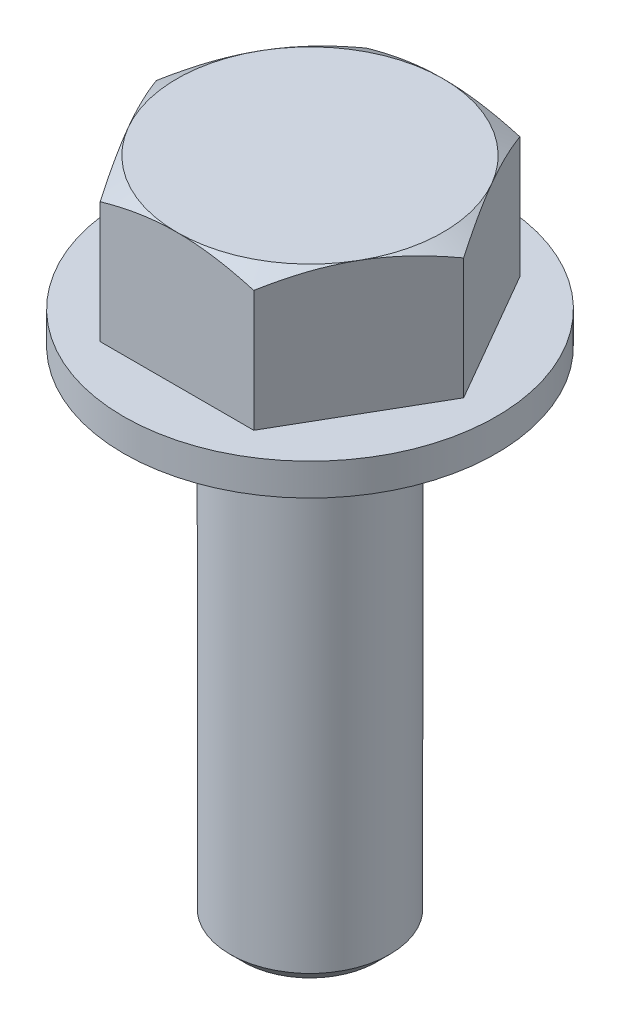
ISO-10303-21;
HEADER;
FILE_DESCRIPTION(('STEP AP214'),'2;1');
FILE_NAME('part.step','',(''),(''),'','','');
FILE_SCHEMA(('AUTOMOTIVE_DESIGN { 1 0 10303 214 1 1 1 1 }'));
ENDSEC;
DATA;
#1=APPLICATION_CONTEXT('core data for automotive mechanical design processes');
#2=APPLICATION_PROTOCOL_DEFINITION('international standard','automotive_design',2000,#1);
#3=PRODUCT_CONTEXT('',#1,'mechanical');
#4=PRODUCT('Part','Part','',(#3));
#5=PRODUCT_RELATED_PRODUCT_CATEGORY('part','',(#4));
#6=PRODUCT_DEFINITION_FORMATION('','',#4);
#7=PRODUCT_DEFINITION_CONTEXT('part definition',#1,'design');
#8=PRODUCT_DEFINITION('design','',#6,#7);
#9=PRODUCT_DEFINITION_SHAPE('','',#8);
#10=(LENGTH_UNIT() NAMED_UNIT(*) SI_UNIT(.MILLI.,.METRE.));
#11=(NAMED_UNIT(*) PLANE_ANGLE_UNIT() SI_UNIT($,.RADIAN.));
#12=(NAMED_UNIT(*) SI_UNIT($,.STERADIAN.) SOLID_ANGLE_UNIT());
#13=UNCERTAINTY_MEASURE_WITH_UNIT(LENGTH_MEASURE(1.E-05),#10,'distance_accuracy_value','');
#14=(GEOMETRIC_REPRESENTATION_CONTEXT(3) GLOBAL_UNCERTAINTY_ASSIGNED_CONTEXT((#13)) GLOBAL_UNIT_ASSIGNED_CONTEXT((#10,
#11,#12)) REPRESENTATION_CONTEXT('',''));
#15=CARTESIAN_POINT('',(0.,0.,0.));
#16=DIRECTION('',(0.,0.,1.));
#17=DIRECTION('',(1.,0.,0.));
#18=AXIS2_PLACEMENT_3D('',#15,#16,#17);
#19=CARTESIAN_POINT('',(8.66025403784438,-2.5,-5.00000000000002));
#20=DIRECTION('',(0.,1.,0.));
#21=DIRECTION('',(0.,0.,1.));
#22=AXIS2_PLACEMENT_3D('',#19,#20,#21);
#23=PLANE('',#22);
#24=CARTESIAN_POINT('',(0.,-2.5,0.));
#25=DIRECTION('',(0.,1.,0.));
#26=DIRECTION('',(0.,0.,1.));
#27=AXIS2_PLACEMENT_3D('',#24,#25,#26);
#28=CIRCLE('',#27,3.);
#29=CARTESIAN_POINT('',(0.,-2.5,3.));
#30=VERTEX_POINT('',#29);
#31=EDGE_CURVE('E147',#30,#30,#28,.F.);
#32=ORIENTED_EDGE('',*,*,#31,.F.);
#33=EDGE_LOOP('',(#32));
#34=FACE_BOUND('',#33,.T.);
#35=CARTESIAN_POINT('',(0.,-2.5,0.));
#36=DIRECTION('',(0.,1.,0.));
#37=DIRECTION('',(0.,0.,1.));
#38=AXIS2_PLACEMENT_3D('',#35,#36,#37);
#39=CIRCLE('',#38,3.5);
#40=CARTESIAN_POINT('',(0.,-2.5,3.5));
#41=VERTEX_POINT('',#40);
#42=EDGE_CURVE('E11',#41,#41,#39,.T.);
#43=ORIENTED_EDGE('',*,*,#42,.F.);
#44=EDGE_LOOP('',(#43));
#45=FACE_BOUND('',#44,.T.);
#46=ADVANCED_FACE('F31',(#34,#45),#23,.F.);
#47=CARTESIAN_POINT('',(0.,-22.5,0.));
#48=DIRECTION('',(0.,1.,0.));
#49=DIRECTION('',(0.,0.,1.));
#50=AXIS2_PLACEMENT_3D('',#47,#48,#49);
#51=CYLINDRICAL_SURFACE('',#50,3.);
#52=CARTESIAN_POINT('',(0.,-22.,0.));
#53=DIRECTION('',(0.,-1.,0.));
#54=DIRECTION('',(0.,0.,-1.));
#55=AXIS2_PLACEMENT_3D('',#52,#53,#54);
#56=CIRCLE('',#55,3.);
#57=CARTESIAN_POINT('',(0.,-22.,-3.));
#58=VERTEX_POINT('',#57);
#59=EDGE_CURVE('E40',#58,#58,#56,.F.);
#60=ORIENTED_EDGE('',*,*,#59,.T.);
#61=EDGE_LOOP('',(#60));
#62=FACE_BOUND('',#61,.T.);
#63=ORIENTED_EDGE('',*,*,#31,.T.);
#64=EDGE_LOOP('',(#63));
#65=FACE_BOUND('',#64,.T.);
#66=ADVANCED_FACE('F155',(#62,#65),#51,.T.);
#67=CARTESIAN_POINT('',(0.,-22.5,0.));
#68=DIRECTION('',(0.,-1.,0.));
#69=DIRECTION('',(0.,0.,-1.));
#70=AXIS2_PLACEMENT_3D('',#67,#68,#69);
#71=PLANE('',#70);
#72=CARTESIAN_POINT('',(0.,-22.5,0.));
#73=DIRECTION('',(0.,-1.,0.));
#74=DIRECTION('',(0.,0.,-1.));
#75=AXIS2_PLACEMENT_3D('',#72,#73,#74);
#76=CIRCLE('',#75,2.50000000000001);
#77=CARTESIAN_POINT('',(0.,-22.5,-2.50000000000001));
#78=VERTEX_POINT('',#77);
#79=EDGE_CURVE('E150',#78,#78,#76,.T.);
#80=ORIENTED_EDGE('',*,*,#79,.T.);
#81=EDGE_LOOP('',(#80));
#82=FACE_BOUND('',#81,.T.);
#83=ADVANCED_FACE('F161',(#82),#71,.T.);
#84=CARTESIAN_POINT('',(0.,-22.5,0.));
#85=DIRECTION('',(0.,1.,0.));
#86=DIRECTION('',(0.,0.,1.));
#87=AXIS2_PLACEMENT_3D('',#84,#85,#86);
#88=CONICAL_SURFACE('',#87,2.50000000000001,0.785398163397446);
#89=ORIENTED_EDGE('',*,*,#59,.F.);
#90=EDGE_LOOP('',(#89));
#91=FACE_BOUND('',#90,.T.);
#92=ORIENTED_EDGE('',*,*,#79,.F.);
#93=EDGE_LOOP('',(#92));
#94=FACE_BOUND('',#93,.T.);
#95=ADVANCED_FACE('F158',(#91,#94),#88,.T.);
#96=CARTESIAN_POINT('',(3.5,-2.5,0.));
#97=DIRECTION('',(0.,-1.,0.));
#98=DIRECTION('',(0.,0.,-1.));
#99=AXIS2_PLACEMENT_3D('',#96,#97,#98);
#100=PLANE('',#99);
#101=CARTESIAN_POINT('',(0.,-2.5,0.));
#102=DIRECTION('',(0.,1.,0.));
#103=DIRECTION('',(0.,0.,1.));
#104=AXIS2_PLACEMENT_3D('',#101,#102,#103);
#105=CIRCLE('',#104,7.);
#106=CARTESIAN_POINT('',(0.,-2.5,7.));
#107=VERTEX_POINT('',#106);
#108=EDGE_CURVE('E428',#107,#107,#105,.T.);
#109=ORIENTED_EDGE('',*,*,#108,.T.);
#110=EDGE_LOOP('',(#109));
#111=FACE_BOUND('',#110,.T.);
#112=DIRECTION('',(-0.5,0.,-0.866025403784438));
#113=VECTOR('',#112,1.);
#114=CARTESIAN_POINT('',(5.77350269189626,-2.5,0.));
#115=LINE('',#114,#113);
#116=CARTESIAN_POINT('',(5.77350269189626,-2.5,0.));
#117=VERTEX_POINT('',#116);
#118=CARTESIAN_POINT('',(2.88675134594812,-2.5,-5.00000000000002));
#119=VERTEX_POINT('',#118);
#120=EDGE_CURVE('E245',#117,#119,#115,.T.);
#121=ORIENTED_EDGE('',*,*,#120,.F.);
#122=DIRECTION('',(0.499999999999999,0.,-0.866025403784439));
#123=VECTOR('',#122,1.);
#124=CARTESIAN_POINT('',(2.88675134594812,-2.5,5.00000000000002));
#125=LINE('',#124,#123);
#126=CARTESIAN_POINT('',(2.88675134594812,-2.5,5.00000000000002));
#127=VERTEX_POINT('',#126);
#128=EDGE_CURVE('E55',#127,#117,#125,.T.);
#129=ORIENTED_EDGE('',*,*,#128,.F.);
#130=DIRECTION('',(1.,0.,0.));
#131=VECTOR('',#130,1.);
#132=CARTESIAN_POINT('',(-2.88675134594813,-2.5,5.00000000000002));
#133=LINE('',#132,#131);
#134=CARTESIAN_POINT('',(-2.88675134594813,-2.5,5.00000000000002));
#135=VERTEX_POINT('',#134);
#136=EDGE_CURVE('E103',#135,#127,#133,.T.);
#137=ORIENTED_EDGE('',*,*,#136,.F.);
#138=DIRECTION('',(0.5,0.,0.866025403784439));
#139=VECTOR('',#138,1.);
#140=CARTESIAN_POINT('',(-5.77350269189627,-2.5,0.));
#141=LINE('',#140,#139);
#142=CARTESIAN_POINT('',(-5.77350269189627,-2.5,0.));
#143=VERTEX_POINT('',#142);
#144=EDGE_CURVE('E107',#143,#135,#141,.T.);
#145=ORIENTED_EDGE('',*,*,#144,.F.);
#146=DIRECTION('',(-0.5,0.,0.866025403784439));
#147=VECTOR('',#146,1.);
#148=CARTESIAN_POINT('',(-2.88675134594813,-2.5,-5.00000000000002));
#149=LINE('',#148,#147);
#150=CARTESIAN_POINT('',(-2.88675134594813,-2.5,-5.00000000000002));
#151=VERTEX_POINT('',#150);
#152=EDGE_CURVE('E127',#151,#143,#149,.T.);
#153=ORIENTED_EDGE('',*,*,#152,.F.);
#154=DIRECTION('',(-1.,0.,0.));
#155=VECTOR('',#154,1.);
#156=CARTESIAN_POINT('',(2.88675134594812,-2.5,-5.00000000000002));
#157=LINE('',#156,#155);
#158=EDGE_CURVE('E129',#119,#151,#157,.T.);
#159=ORIENTED_EDGE('',*,*,#158,.F.);
#160=EDGE_LOOP('',(#121,#129,#137,#145,#153,#159));
#161=FACE_BOUND('',#160,.T.);
#162=ADVANCED_FACE('F105',(#111,#161),#100,.F.);
#163=CARTESIAN_POINT('',(0.,0.,0.));
#164=DIRECTION('',(0.,1.,0.));
#165=DIRECTION('',(0.,0.,1.));
#166=AXIS2_PLACEMENT_3D('',#163,#164,#165);
#167=CYLINDRICAL_SURFACE('',#166,3.5);
#168=CARTESIAN_POINT('',(0.,-3.7,0.));
#169=DIRECTION('',(0.,1.,0.));
#170=DIRECTION('',(0.,0.,1.));
#171=AXIS2_PLACEMENT_3D('',#168,#169,#170);
#172=CIRCLE('',#171,3.5);
#173=CARTESIAN_POINT('',(0.,-3.7,3.5));
#174=VERTEX_POINT('',#173);
#175=EDGE_CURVE('E200',#174,#174,#172,.T.);
#176=ORIENTED_EDGE('',*,*,#175,.F.);
#177=EDGE_LOOP('',(#176));
#178=FACE_BOUND('',#177,.T.);
#179=ORIENTED_EDGE('',*,*,#42,.T.);
#180=EDGE_LOOP('',(#179));
#181=FACE_BOUND('',#180,.T.);
#182=ADVANCED_FACE('F349',(#178,#181),#167,.F.);
#183=CARTESIAN_POINT('',(3.5,-3.7,0.));
#184=DIRECTION('',(0.,1.,0.));
#185=DIRECTION('',(0.,0.,1.));
#186=AXIS2_PLACEMENT_3D('',#183,#184,#185);
#187=PLANE('',#186);
#188=CARTESIAN_POINT('',(0.,-3.7,0.));
#189=DIRECTION('',(0.,1.,0.));
#190=DIRECTION('',(0.,0.,1.));
#191=AXIS2_PLACEMENT_3D('',#188,#189,#190);
#192=CIRCLE('',#191,7.);
#193=CARTESIAN_POINT('',(0.,-3.7,7.));
#194=VERTEX_POINT('',#193);
#195=EDGE_CURVE('E431',#194,#194,#192,.T.);
#196=ORIENTED_EDGE('',*,*,#195,.F.);
#197=EDGE_LOOP('',(#196));
#198=FACE_BOUND('',#197,.T.);
#199=ORIENTED_EDGE('',*,*,#175,.T.);
#200=EDGE_LOOP('',(#199));
#201=FACE_BOUND('',#200,.T.);
#202=ADVANCED_FACE('F359',(#198,#201),#187,.F.);
#203=CARTESIAN_POINT('',(0.,0.,0.));
#204=DIRECTION('',(0.,1.,0.));
#205=DIRECTION('',(0.,0.,1.));
#206=AXIS2_PLACEMENT_3D('',#203,#204,#205);
#207=CYLINDRICAL_SURFACE('',#206,7.);
#208=ORIENTED_EDGE('',*,*,#108,.F.);
#209=EDGE_LOOP('',(#208));
#210=FACE_BOUND('',#209,.T.);
#211=ORIENTED_EDGE('',*,*,#195,.T.);
#212=EDGE_LOOP('',(#211));
#213=FACE_BOUND('',#212,.T.);
#214=ADVANCED_FACE('F186',(#210,#213),#207,.T.);
#215=CARTESIAN_POINT('',(8.66025403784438,2.5,-5.00000000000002));
#216=DIRECTION('',(0.,1.,0.));
#217=DIRECTION('',(0.,0.,1.));
#218=AXIS2_PLACEMENT_3D('',#215,#216,#217);
#219=PLANE('',#218);
#220=CARTESIAN_POINT('',(0.,2.5,0.));
#221=DIRECTION('',(0.,1.,0.));
#222=DIRECTION('',(0.,0.,1.));
#223=AXIS2_PLACEMENT_3D('',#220,#221,#222);
#224=CIRCLE('',#223,5.00000000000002);
#225=CARTESIAN_POINT('',(-4.3301270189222,2.5,2.5));
#226=VERTEX_POINT('',#225);
#227=CARTESIAN_POINT('',(0.,2.5,5.00000000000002));
#228=VERTEX_POINT('',#227);
#229=EDGE_CURVE('E47',#226,#228,#224,.T.);
#230=ORIENTED_EDGE('',*,*,#229,.T.);
#231=CARTESIAN_POINT('',(4.33012701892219,2.5,2.5));
#232=VERTEX_POINT('',#231);
#233=EDGE_CURVE('E146',#228,#232,#224,.T.);
#234=ORIENTED_EDGE('',*,*,#233,.T.);
#235=CARTESIAN_POINT('',(4.3301270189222,2.5,-2.5));
#236=VERTEX_POINT('',#235);
#237=EDGE_CURVE('E266',#232,#236,#224,.T.);
#238=ORIENTED_EDGE('',*,*,#237,.T.);
#239=CARTESIAN_POINT('',(0.,2.5,-5.00000000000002));
#240=VERTEX_POINT('',#239);
#241=EDGE_CURVE('E265',#236,#240,#224,.T.);
#242=ORIENTED_EDGE('',*,*,#241,.T.);
#243=CARTESIAN_POINT('',(-4.3301270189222,2.5,-2.5));
#244=VERTEX_POINT('',#243);
#245=EDGE_CURVE('E259',#240,#244,#224,.T.);
#246=ORIENTED_EDGE('',*,*,#245,.T.);
#247=EDGE_CURVE('E145',#244,#226,#224,.T.);
#248=ORIENTED_EDGE('',*,*,#247,.T.);
#249=EDGE_LOOP('',(#230,#234,#238,#242,#246,#248));
#250=FACE_BOUND('',#249,.T.);
#251=ADVANCED_FACE('F182',(#250),#219,.T.);
#252=CARTESIAN_POINT('',(0.,4.23205080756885,0.));
#253=DIRECTION('',(0.,-1.,0.));
#254=DIRECTION('',(0.,0.,-1.));
#255=AXIS2_PLACEMENT_3D('',#252,#253,#254);
#256=CONICAL_SURFACE('',#255,2.00000000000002,1.0471975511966);
#257=CARTESIAN_POINT('',(5.7736181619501,2.05335134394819,0.000199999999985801));
#258=CARTESIAN_POINT('',(5.64675433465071,2.12661343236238,-0.219534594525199));
#259=CARTESIAN_POINT('',(5.5188054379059,2.19324867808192,-0.441148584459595));
#260=CARTESIAN_POINT('',(5.26069210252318,2.3095610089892,-0.888213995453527));
#261=CARTESIAN_POINT('',(5.13052307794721,2.35919695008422,-1.11367335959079));
#262=CARTESIAN_POINT('',(4.87177839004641,2.43644897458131,-1.56183230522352));
#263=CARTESIAN_POINT('',(4.74324302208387,2.46457962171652,-1.7844620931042));
#264=CARTESIAN_POINT('',(4.54998783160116,2.48980507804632,-2.11918990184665));
#265=CARTESIAN_POINT('',(4.48552534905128,2.49538654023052,-2.23084219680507));
#266=CARTESIAN_POINT('',(4.35654081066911,2.50079778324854,-2.45424997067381));
#267=CARTESIAN_POINT('',(4.2920187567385,2.5006277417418,-2.56600544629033));
#268=CARTESIAN_POINT('',(4.11524635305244,2.49224636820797,-2.87218423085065));
#269=CARTESIAN_POINT('',(4.00305457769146,2.47817022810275,-3.06650608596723));
#270=CARTESIAN_POINT('',(3.77941563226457,2.43353474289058,-3.45386010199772));
#271=CARTESIAN_POINT('',(3.66796924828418,2.4029601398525,-3.64689090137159));
#272=CARTESIAN_POINT('',(3.44387972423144,2.32653150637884,-4.03502534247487));
#273=CARTESIAN_POINT('',(3.3312648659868,2.28035362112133,-4.23007999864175));
#274=CARTESIAN_POINT('',(3.1077146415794,2.17554820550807,-4.61728034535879));
#275=CARTESIAN_POINT('',(2.99677641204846,2.11694529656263,-4.80943099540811));
#276=CARTESIAN_POINT('',(2.88663587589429,2.05335134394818,-5.00020000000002));
#277=B_SPLINE_CURVE_WITH_KNOTS('',3,(#257,#258,#259,#260,#261,#262,#263,#264,#265,#266,#267,
#268,#269,#270,#271,#272,#273,#274,#275,#276),.UNSPECIFIED.,.F.,.F.,(4,2,2,2,2,2,2,2,2,4),(0.,
0.79255584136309,1.58701660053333,2.3618153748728,2.74884076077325,3.13585419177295,
3.80962362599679,4.48401723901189,5.17336882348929,5.86136694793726),.UNSPECIFIED.);
#278=CARTESIAN_POINT('',(5.77350269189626,2.05341801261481,0.));
#279=VERTEX_POINT('',#278);
#280=EDGE_CURVE('E207',#279,#236,#277,.T.);
#281=ORIENTED_EDGE('',*,*,#280,.T.);
#282=ORIENTED_EDGE('',*,*,#237,.F.);
#283=CARTESIAN_POINT('',(2.88663587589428,2.05335134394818,5.00020000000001));
#284=CARTESIAN_POINT('',(3.01349970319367,2.12661343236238,4.78046540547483));
#285=CARTESIAN_POINT('',(3.14144859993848,2.19324867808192,4.55885141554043));
#286=CARTESIAN_POINT('',(3.3995619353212,2.3095610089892,4.1117860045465));
#287=CARTESIAN_POINT('',(3.52973095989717,2.35919695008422,3.88632664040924));
#288=CARTESIAN_POINT('',(3.78847564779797,2.43644897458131,3.4381676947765));
#289=CARTESIAN_POINT('',(3.91701101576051,2.46457962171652,3.21553790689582));
#290=CARTESIAN_POINT('',(4.11026620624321,2.48980507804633,2.88081009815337));
#291=CARTESIAN_POINT('',(4.1747286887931,2.49538654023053,2.76915780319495));
#292=CARTESIAN_POINT('',(4.30371322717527,2.50079778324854,2.54575002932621));
#293=CARTESIAN_POINT('',(4.36823528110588,2.50062774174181,2.4339945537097));
#294=CARTESIAN_POINT('',(4.54500768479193,2.49224636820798,2.12781576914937));
#295=CARTESIAN_POINT('',(4.65719946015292,2.47817022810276,1.93349391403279));
#296=CARTESIAN_POINT('',(4.88083840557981,2.43353474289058,1.5461398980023));
#297=CARTESIAN_POINT('',(4.9922847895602,2.40296013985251,1.35310909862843));
#298=CARTESIAN_POINT('',(5.21637431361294,2.32653150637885,0.964974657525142));
#299=CARTESIAN_POINT('',(5.32898917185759,2.28035362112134,0.769920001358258));
#300=CARTESIAN_POINT('',(5.55253939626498,2.17554820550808,0.382719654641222));
#301=CARTESIAN_POINT('',(5.66347762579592,2.11694529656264,0.190569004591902));
#302=CARTESIAN_POINT('',(5.7736181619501,2.05335134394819,-0.000200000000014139));
#303=B_SPLINE_CURVE_WITH_KNOTS('',3,(#283,#284,#285,#286,#287,#288,#289,#290,#291,#292,#293,
#294,#295,#296,#297,#298,#299,#300,#301,#302),.UNSPECIFIED.,.F.,.F.,(4,2,2,2,2,2,2,2,2,4),(0.,
0.792555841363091,1.58701660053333,2.36181537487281,2.74884076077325,3.13585419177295,
3.8096236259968,4.48401723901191,5.17336882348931,5.86136694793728),.UNSPECIFIED.);
#304=EDGE_CURVE('E199',#232,#279,#303,.T.);
#305=ORIENTED_EDGE('',*,*,#304,.T.);
#306=EDGE_LOOP('',(#281,#282,#305));
#307=FACE_BOUND('',#306,.T.);
#308=ADVANCED_FACE('F185',(#307),#256,.T.);
#309=CARTESIAN_POINT('',(-7.83582824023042,0.0201818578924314,-5.00000000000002));
#310=CARTESIAN_POINT('',(-7.61675258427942,0.126778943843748,-5.00000000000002));
#311=CARTESIAN_POINT('',(-7.39718272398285,0.232377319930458,-5.00000000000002));
#312=CARTESIAN_POINT('',(-6.95679209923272,0.441016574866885,-5.00000000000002));
#313=CARTESIAN_POINT('',(-6.73597115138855,0.54405706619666,-5.00000000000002));
#314=CARTESIAN_POINT('',(-6.29171673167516,0.747521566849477,-5.00000000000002));
#315=CARTESIAN_POINT('',(-6.06827562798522,0.847928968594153,-5.00000000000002));
#316=CARTESIAN_POINT('',(-5.61964466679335,1.04474266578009,-5.00000000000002));
#317=CARTESIAN_POINT('',(-5.39445489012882,1.14114914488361,-5.00000000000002));
#318=CARTESIAN_POINT('',(-4.93438073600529,1.33205603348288,-5.00000000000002));
#319=CARTESIAN_POINT('',(-4.69942447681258,1.42638413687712,-5.00000000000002));
#320=CARTESIAN_POINT('',(-4.22679335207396,1.60809698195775,-5.00000000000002));
#321=CARTESIAN_POINT('',(-3.98911818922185,1.69548095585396,-5.00000000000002));
#322=CARTESIAN_POINT('',(-3.51109032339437,1.86107114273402,-5.00000000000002));
#323=CARTESIAN_POINT('',(-3.27074388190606,1.93929525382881,-5.00000000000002));
#324=CARTESIAN_POINT('',(-2.78660382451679,2.08410963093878,-5.00000000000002));
#325=CARTESIAN_POINT('',(-2.54281129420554,2.15070347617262,-5.00000000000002));
#326=CARTESIAN_POINT('',(-2.05301710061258,2.26875493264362,-5.00000000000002));
#327=CARTESIAN_POINT('',(-1.80703640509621,2.32029796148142,-5.00000000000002));
#328=CARTESIAN_POINT('',(-1.31193168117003,2.40539626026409,-5.00000000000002));
#329=CARTESIAN_POINT('',(-1.0628079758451,2.43895336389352,-5.00000000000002));
#330=CARTESIAN_POINT('',(-0.565948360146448,2.48496717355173,-5.00000000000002));
#331=CARTESIAN_POINT('',(-0.318238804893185,2.49770143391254,-5.00000000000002));
#332=CARTESIAN_POINT('',(0.177377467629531,2.50172580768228,-5.00000000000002));
#333=CARTESIAN_POINT('',(0.425284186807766,2.4930157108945,-5.00000000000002));
#334=CARTESIAN_POINT('',(0.843772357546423,2.46083600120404,-5.00000000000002));
#335=CARTESIAN_POINT('',(1.01479089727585,2.44270146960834,-5.00000000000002));
#336=CARTESIAN_POINT('',(1.35562158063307,2.39731277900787,-5.00000000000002));
#337=CARTESIAN_POINT('',(1.52543356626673,2.37005744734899,-5.00000000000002));
#338=CARTESIAN_POINT('',(2.0328088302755,2.2760379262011,-5.00000000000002));
#339=CARTESIAN_POINT('',(2.36813213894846,2.19703587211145,-5.00000000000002));
#340=CARTESIAN_POINT('',(2.86963272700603,2.05946652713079,-5.00000000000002));
#341=CARTESIAN_POINT('',(3.03839424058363,2.00977811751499,-5.00000000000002));
#342=CARTESIAN_POINT('',(3.37427940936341,1.90509537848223,-5.00000000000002));
#343=CARTESIAN_POINT('',(3.54140305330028,1.85010101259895,-5.00000000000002));
#344=CARTESIAN_POINT('',(3.87406252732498,1.73570084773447,-5.00000000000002));
#345=CARTESIAN_POINT('',(4.03959882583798,1.67629639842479,-5.00000000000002));
#346=CARTESIAN_POINT('',(4.36929036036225,1.55378935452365,-5.00000000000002));
#347=CARTESIAN_POINT('',(4.53344561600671,1.49068681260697,-5.00000000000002));
#348=CARTESIAN_POINT('',(4.93359002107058,1.33251408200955,-5.00000000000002));
#349=CARTESIAN_POINT('',(5.16891080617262,1.23575576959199,-5.00000000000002));
#350=CARTESIAN_POINT('',(5.63743106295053,1.03721704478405,-5.00000000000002));
#351=CARTESIAN_POINT('',(5.87063037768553,0.935436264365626,-5.00000000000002));
#352=CARTESIAN_POINT('',(6.33531777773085,0.727904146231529,-5.00000000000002));
#353=CARTESIAN_POINT('',(6.56680543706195,0.622151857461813,-5.00000000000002));
#354=CARTESIAN_POINT('',(7.02832278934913,0.407506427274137,-5.00000000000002));
#355=CARTESIAN_POINT('',(7.25835244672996,0.298613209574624,-5.00000000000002));
#356=CARTESIAN_POINT('',(7.71747583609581,0.0781683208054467,-5.00000000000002));
#357=CARTESIAN_POINT('',(7.94656809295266,-0.0333864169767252,-5.00000000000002));
#358=CARTESIAN_POINT('',(8.40373705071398,-0.258559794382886,-5.00000000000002));
#359=CARTESIAN_POINT('',(8.63181374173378,-0.372178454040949,-5.00000000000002));
#360=CARTESIAN_POINT('',(9.31470112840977,-0.715524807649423,-5.00000000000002));
#361=CARTESIAN_POINT('',(9.76824174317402,-0.947778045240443,-5.00000000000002));
#362=CARTESIAN_POINT('',(10.6324695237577,-1.39599360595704,-5.00000000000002));
#363=CARTESIAN_POINT('',(11.0433644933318,-1.61155711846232,-5.00000000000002));
#364=CARTESIAN_POINT('',(11.8636388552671,-2.04558815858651,-5.00000000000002));
#365=CARTESIAN_POINT('',(12.2730181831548,-2.26405580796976,-5.00000000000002));
#366=CARTESIAN_POINT('',(13.0894643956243,-2.70257621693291,-5.00000000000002));
#367=CARTESIAN_POINT('',(13.4965345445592,-2.92262290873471,-5.00000000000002));
#368=CARTESIAN_POINT('',(14.3097130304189,-3.36442738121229,-5.00000000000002));
#369=CARTESIAN_POINT('',(14.7158214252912,-3.58618505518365,-5.00000000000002));
#370=CARTESIAN_POINT('',(15.1215799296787,-3.80857680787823,-5.00000000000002));
#371=B_SPLINE_CURVE_WITH_KNOTS('',3,(#309,#310,#311,#312,#313,#314,#315,#316,#317,#318,#319,
#320,#321,#322,#323,#324,#325,#326,#327,#328,#329,#330,#331,#332,#333,#334,#335,#336,#337,#338,
#339,#340,#341,#342,#343,#344,#345,#346,#347,#348,#349,#350,#351,#352,#353,#354,#355,#356,#357,
#358,#359,#360,#361,#362,#363,#364,#365,#366,#367,#368,#369,#370),.UNSPECIFIED.,.F.,.F.,(4,2,2,
2,2,2,2,2,2,2,2,2,2,2,2,2,2,2,2,2,2,2,2,2,2,2,2,2,2,2,4),(0.,0.730907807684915,1.46192568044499,
2.19678752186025,2.93161559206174,3.69108328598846,4.450634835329,5.20867656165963,
5.96648458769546,6.71990430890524,7.47324720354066,8.21646418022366,8.95968844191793,
9.47537174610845,9.99112137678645,11.0231580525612,11.5508843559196,12.0786142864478,
12.6061833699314,13.1337449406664,13.8969744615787,14.6602599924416,15.4237294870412,
16.187217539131,16.9516324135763,17.7160547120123,19.2446573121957,20.636665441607,
22.0287321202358,23.416942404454,24.805066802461),.UNSPECIFIED.);
#372=CARTESIAN_POINT('',(2.88675134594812,2.05341801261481,-5.00000000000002));
#373=VERTEX_POINT('',#372);
#374=EDGE_CURVE('E213',#373,#240,#371,.F.);
#375=ORIENTED_EDGE('',*,*,#374,.T.);
#376=ORIENTED_EDGE('',*,*,#241,.F.);
#377=EDGE_CURVE('E212',#236,#373,#277,.T.);
#378=ORIENTED_EDGE('',*,*,#377,.T.);
#379=EDGE_LOOP('',(#375,#376,#378));
#380=FACE_BOUND('',#379,.T.);
#381=ADVANCED_FACE('F278',(#380),#256,.T.);
#382=CARTESIAN_POINT('',(-2.8866358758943,2.05335134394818,-5.00020000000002));
#383=CARTESIAN_POINT('',(-3.01349970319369,2.12661343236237,-4.78046540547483));
#384=CARTESIAN_POINT('',(-3.1414485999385,2.19324867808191,-4.55885141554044));
#385=CARTESIAN_POINT('',(-3.39956193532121,2.30956100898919,-4.1117860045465));
#386=CARTESIAN_POINT('',(-3.52973095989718,2.35919695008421,-3.88632664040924));
#387=CARTESIAN_POINT('',(-3.78847564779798,2.43644897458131,-3.4381676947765));
#388=CARTESIAN_POINT('',(-3.91701101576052,2.46457962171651,-3.21553790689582));
#389=CARTESIAN_POINT('',(-4.11026620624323,2.48980507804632,-2.88081009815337));
#390=CARTESIAN_POINT('',(-4.17472868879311,2.49538654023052,-2.76915780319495));
#391=CARTESIAN_POINT('',(-4.30371322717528,2.50079778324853,-2.54575002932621));
#392=CARTESIAN_POINT('',(-4.3682352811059,2.5006277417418,-2.4339945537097));
#393=CARTESIAN_POINT('',(-4.54500768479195,2.49224636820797,-2.12781576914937));
#394=CARTESIAN_POINT('',(-4.65719946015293,2.47817022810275,-1.9334939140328));
#395=CARTESIAN_POINT('',(-4.88083840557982,2.43353474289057,-1.5461398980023));
#396=CARTESIAN_POINT('',(-4.99228478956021,2.4029601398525,-1.35310909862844));
#397=CARTESIAN_POINT('',(-5.21637431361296,2.32653150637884,-0.964974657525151));
#398=CARTESIAN_POINT('',(-5.3289891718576,2.28035362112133,-0.769920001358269));
#399=CARTESIAN_POINT('',(-5.55253939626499,2.17554820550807,-0.382719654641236));
#400=CARTESIAN_POINT('',(-5.66347762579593,2.11694529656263,-0.190569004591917));
#401=CARTESIAN_POINT('',(-5.77361816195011,2.05335134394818,0.000199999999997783));
#402=B_SPLINE_CURVE_WITH_KNOTS('',3,(#382,#383,#384,#385,#386,#387,#388,#389,#390,#391,#392,
#393,#394,#395,#396,#397,#398,#399,#400,#401),.UNSPECIFIED.,.F.,.F.,(4,2,2,2,2,2,2,2,2,4),(0.,
0.792555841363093,1.58701660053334,2.36181537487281,2.74884076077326,3.13585419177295,
3.8096236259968,4.4840172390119,5.1733688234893,5.86136694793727),.UNSPECIFIED.);
#403=CARTESIAN_POINT('',(-2.88675134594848,2.05341801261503,-5.00000000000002));
#404=VERTEX_POINT('',#403);
#405=EDGE_CURVE('E231',#404,#244,#402,.T.);
#406=ORIENTED_EDGE('',*,*,#405,.T.);
#407=ORIENTED_EDGE('',*,*,#245,.F.);
#408=EDGE_CURVE('E237',#240,#404,#371,.F.);
#409=ORIENTED_EDGE('',*,*,#408,.T.);
#410=EDGE_LOOP('',(#406,#407,#409));
#411=FACE_BOUND('',#410,.T.);
#412=ADVANCED_FACE('F257',(#411),#256,.T.);
#413=CARTESIAN_POINT('',(-5.77361816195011,2.05335134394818,-0.000200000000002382));
#414=CARTESIAN_POINT('',(-5.64675433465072,2.12661343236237,0.219534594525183));
#415=CARTESIAN_POINT('',(-5.51880543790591,2.19324867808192,0.441148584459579));
#416=CARTESIAN_POINT('',(-5.26069210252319,2.3095610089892,0.888213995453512));
#417=CARTESIAN_POINT('',(-5.13052307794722,2.35919695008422,1.11367335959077));
#418=CARTESIAN_POINT('',(-4.87177839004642,2.43644897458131,1.56183230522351));
#419=CARTESIAN_POINT('',(-4.74324302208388,2.46457962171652,1.78446209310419));
#420=CARTESIAN_POINT('',(-4.54998783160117,2.48980507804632,2.11918990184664));
#421=CARTESIAN_POINT('',(-4.48552534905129,2.49538654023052,2.23084219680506));
#422=CARTESIAN_POINT('',(-4.35654081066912,2.50079778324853,2.4542499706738));
#423=CARTESIAN_POINT('',(-4.29201875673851,2.5006277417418,2.56600544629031));
#424=CARTESIAN_POINT('',(-4.11524635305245,2.49224636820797,2.87218423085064));
#425=CARTESIAN_POINT('',(-4.00305457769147,2.47817022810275,3.06650608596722));
#426=CARTESIAN_POINT('',(-3.77941563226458,2.43353474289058,3.45386010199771));
#427=CARTESIAN_POINT('',(-3.66796924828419,2.4029601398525,3.64689090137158));
#428=CARTESIAN_POINT('',(-3.44387972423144,2.32653150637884,4.03502534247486));
#429=CARTESIAN_POINT('',(-3.33126486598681,2.28035362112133,4.23007999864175));
#430=CARTESIAN_POINT('',(-3.10771464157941,2.17554820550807,4.61728034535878));
#431=CARTESIAN_POINT('',(-2.99677641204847,2.11694529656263,4.8094309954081));
#432=CARTESIAN_POINT('',(-2.88663587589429,2.05335134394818,5.00020000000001));
#433=B_SPLINE_CURVE_WITH_KNOTS('',3,(#413,#414,#415,#416,#417,#418,#419,#420,#421,#422,#423,
#424,#425,#426,#427,#428,#429,#430,#431,#432),.UNSPECIFIED.,.F.,.F.,(4,2,2,2,2,2,2,2,2,4),(0.,
0.792555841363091,1.58701660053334,2.36181537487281,2.74884076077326,3.13585419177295,
3.8096236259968,4.4840172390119,5.1733688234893,5.86136694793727),.UNSPECIFIED.);
#434=CARTESIAN_POINT('',(-5.77350269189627,2.05341801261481,0.));
#435=VERTEX_POINT('',#434);
#436=EDGE_CURVE('E238',#435,#226,#433,.T.);
#437=ORIENTED_EDGE('',*,*,#436,.T.);
#438=ORIENTED_EDGE('',*,*,#247,.F.);
#439=EDGE_CURVE('E236',#244,#435,#402,.T.);
#440=ORIENTED_EDGE('',*,*,#439,.T.);
#441=EDGE_LOOP('',(#437,#438,#440));
#442=FACE_BOUND('',#441,.T.);
#443=ADVANCED_FACE('F262',(#442),#256,.T.);
#444=CARTESIAN_POINT('',(2.88675134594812,2.05341801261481,5.00000000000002));
#445=VERTEX_POINT('',#444);
#446=EDGE_CURVE('E206',#445,#232,#303,.T.);
#447=ORIENTED_EDGE('',*,*,#446,.T.);
#448=ORIENTED_EDGE('',*,*,#233,.F.);
#449=CARTESIAN_POINT('',(-7.83582824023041,0.0201818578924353,5.00000000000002));
#450=CARTESIAN_POINT('',(-7.61675258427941,0.126778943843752,5.00000000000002));
#451=CARTESIAN_POINT('',(-7.39718272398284,0.232377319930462,5.00000000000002));
#452=CARTESIAN_POINT('',(-6.95679209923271,0.441016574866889,5.00000000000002));
#453=CARTESIAN_POINT('',(-6.73597115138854,0.544057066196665,5.00000000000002));
#454=CARTESIAN_POINT('',(-6.29171673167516,0.747521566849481,5.00000000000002));
#455=CARTESIAN_POINT('',(-6.06827562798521,0.847928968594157,5.00000000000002));
#456=CARTESIAN_POINT('',(-5.61964466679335,1.0447426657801,5.00000000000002));
#457=CARTESIAN_POINT('',(-5.39445489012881,1.14114914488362,5.00000000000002));
#458=CARTESIAN_POINT('',(-4.93438073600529,1.33205603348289,5.00000000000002));
#459=CARTESIAN_POINT('',(-4.69942447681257,1.42638413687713,5.00000000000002));
#460=CARTESIAN_POINT('',(-4.22679335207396,1.60809698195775,5.00000000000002));
#461=CARTESIAN_POINT('',(-3.98911818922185,1.69548095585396,5.00000000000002));
#462=CARTESIAN_POINT('',(-3.51109032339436,1.86107114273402,5.00000000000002));
#463=CARTESIAN_POINT('',(-3.27074388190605,1.93929525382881,5.00000000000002));
#464=CARTESIAN_POINT('',(-2.78660382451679,2.08410963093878,5.00000000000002));
#465=CARTESIAN_POINT('',(-2.54281129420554,2.15070347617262,5.00000000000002));
#466=CARTESIAN_POINT('',(-2.05301710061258,2.26875493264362,5.00000000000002));
#467=CARTESIAN_POINT('',(-1.80703640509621,2.32029796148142,5.00000000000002));
#468=CARTESIAN_POINT('',(-1.31193168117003,2.40539626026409,5.00000000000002));
#469=CARTESIAN_POINT('',(-1.0628079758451,2.43895336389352,5.00000000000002));
#470=CARTESIAN_POINT('',(-0.565948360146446,2.48496717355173,5.00000000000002));
#471=CARTESIAN_POINT('',(-0.318238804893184,2.49770143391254,5.00000000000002));
#472=CARTESIAN_POINT('',(0.177377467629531,2.50172580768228,5.00000000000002));
#473=CARTESIAN_POINT('',(0.425284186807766,2.4930157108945,5.00000000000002));
#474=CARTESIAN_POINT('',(0.843772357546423,2.46083600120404,5.00000000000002));
#475=CARTESIAN_POINT('',(1.01479089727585,2.44270146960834,5.00000000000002));
#476=CARTESIAN_POINT('',(1.35562158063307,2.39731277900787,5.00000000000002));
#477=CARTESIAN_POINT('',(1.52543356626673,2.37005744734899,5.00000000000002));
#478=CARTESIAN_POINT('',(2.0328088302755,2.2760379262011,5.00000000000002));
#479=CARTESIAN_POINT('',(2.36813213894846,2.19703587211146,5.00000000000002));
#480=CARTESIAN_POINT('',(2.86963272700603,2.05946652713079,5.00000000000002));
#481=CARTESIAN_POINT('',(3.03839424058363,2.009778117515,5.00000000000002));
#482=CARTESIAN_POINT('',(3.37427940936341,1.90509537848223,5.00000000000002));
#483=CARTESIAN_POINT('',(3.54140305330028,1.85010101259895,5.00000000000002));
#484=CARTESIAN_POINT('',(3.87406252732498,1.73570084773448,5.00000000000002));
#485=CARTESIAN_POINT('',(4.03959882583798,1.6762963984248,5.00000000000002));
#486=CARTESIAN_POINT('',(4.36929036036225,1.55378935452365,5.00000000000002));
#487=CARTESIAN_POINT('',(4.53344561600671,1.49068681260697,5.00000000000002));
#488=CARTESIAN_POINT('',(4.93359002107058,1.33251408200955,5.00000000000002));
#489=CARTESIAN_POINT('',(5.16891080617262,1.23575576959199,5.00000000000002));
#490=CARTESIAN_POINT('',(5.63743106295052,1.03721704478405,5.00000000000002));
#491=CARTESIAN_POINT('',(5.87063037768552,0.935436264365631,5.00000000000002));
#492=CARTESIAN_POINT('',(6.33531777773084,0.727904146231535,5.00000000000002));
#493=CARTESIAN_POINT('',(6.56680543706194,0.62215185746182,5.00000000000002));
#494=CARTESIAN_POINT('',(7.02832278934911,0.407506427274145,5.00000000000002));
#495=CARTESIAN_POINT('',(7.25835244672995,0.298613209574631,5.00000000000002));
#496=CARTESIAN_POINT('',(7.71747583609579,0.078168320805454,5.00000000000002));
#497=CARTESIAN_POINT('',(7.94656809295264,-0.0333864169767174,5.00000000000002));
#498=CARTESIAN_POINT('',(8.40373705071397,-0.258559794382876,5.00000000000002));
#499=CARTESIAN_POINT('',(8.63181374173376,-0.372178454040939,5.00000000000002));
#500=CARTESIAN_POINT('',(9.31470112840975,-0.715524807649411,5.00000000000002));
#501=CARTESIAN_POINT('',(9.76824174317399,-0.94777804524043,5.00000000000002));
#502=CARTESIAN_POINT('',(10.6324695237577,-1.39599360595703,5.00000000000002));
#503=CARTESIAN_POINT('',(11.0433644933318,-1.61155711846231,5.00000000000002));
#504=CARTESIAN_POINT('',(11.8636388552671,-2.0455881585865,5.00000000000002));
#505=CARTESIAN_POINT('',(12.2730181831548,-2.26405580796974,5.00000000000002));
#506=CARTESIAN_POINT('',(13.0894643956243,-2.7025762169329,5.00000000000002));
#507=CARTESIAN_POINT('',(13.4965345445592,-2.92262290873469,5.00000000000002));
#508=CARTESIAN_POINT('',(14.3097130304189,-3.36442738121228,5.00000000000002));
#509=CARTESIAN_POINT('',(14.7158214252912,-3.58618505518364,5.00000000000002));
#510=CARTESIAN_POINT('',(15.1215799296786,-3.80857680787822,5.00000000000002));
#511=B_SPLINE_CURVE_WITH_KNOTS('',3,(#449,#450,#451,#452,#453,#454,#455,#456,#457,#458,#459,
#460,#461,#462,#463,#464,#465,#466,#467,#468,#469,#470,#471,#472,#473,#474,#475,#476,#477,#478,
#479,#480,#481,#482,#483,#484,#485,#486,#487,#488,#489,#490,#491,#492,#493,#494,#495,#496,#497,
#498,#499,#500,#501,#502,#503,#504,#505,#506,#507,#508,#509,#510),.UNSPECIFIED.,.F.,.F.,(4,2,2,
2,2,2,2,2,2,2,2,2,2,2,2,2,2,2,2,2,2,2,2,2,2,2,2,2,2,2,4),(0.,0.730907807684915,1.46192568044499,
2.19678752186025,2.93161559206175,3.69108328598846,4.450634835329,5.20867656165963,
5.96648458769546,6.71990430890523,7.47324720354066,8.21646418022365,8.95968844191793,
9.47537174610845,9.99112137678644,11.0231580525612,11.5508843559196,12.0786142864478,
12.6061833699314,13.1337449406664,13.8969744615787,14.6602599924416,15.4237294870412,
16.1872175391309,16.9516324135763,17.7160547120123,19.2446573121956,20.636665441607,
22.0287321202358,23.416942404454,24.805066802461),.UNSPECIFIED.);
#512=EDGE_CURVE('E193',#228,#445,#511,.T.);
#513=ORIENTED_EDGE('',*,*,#512,.T.);
#514=EDGE_LOOP('',(#447,#448,#513));
#515=FACE_BOUND('',#514,.T.);
#516=ADVANCED_FACE('F284',(#515),#256,.T.);
#517=CARTESIAN_POINT('',(-2.88675134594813,2.0534180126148,5.00000000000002));
#518=VERTEX_POINT('',#517);
#519=EDGE_CURVE('E118',#518,#228,#511,.T.);
#520=ORIENTED_EDGE('',*,*,#519,.T.);
#521=ORIENTED_EDGE('',*,*,#229,.F.);
#522=EDGE_CURVE('E243',#226,#518,#433,.T.);
#523=ORIENTED_EDGE('',*,*,#522,.T.);
#524=EDGE_LOOP('',(#520,#521,#523));
#525=FACE_BOUND('',#524,.T.);
#526=ADVANCED_FACE('F180',(#525),#256,.T.);
#527=CARTESIAN_POINT('',(-2.88675134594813,2.5,5.00000000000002));
#528=DIRECTION('',(0.,0.,-1.));
#529=DIRECTION('',(-1.,0.,0.));
#530=AXIS2_PLACEMENT_3D('',#527,#528,#529);
#531=PLANE('',#530);
#532=ORIENTED_EDGE('',*,*,#519,.F.);
#533=DIRECTION('',(0.,-1.,0.));
#534=VECTOR('',#533,1.);
#535=CARTESIAN_POINT('',(-2.88675134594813,2.5,5.00000000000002));
#536=LINE('',#535,#534);
#537=EDGE_CURVE('E115',#518,#135,#536,.T.);
#538=ORIENTED_EDGE('',*,*,#537,.T.);
#539=ORIENTED_EDGE('',*,*,#136,.T.);
#540=DIRECTION('',(0.,-1.,0.));
#541=VECTOR('',#540,1.);
#542=CARTESIAN_POINT('',(2.88675134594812,2.5,5.00000000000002));
#543=LINE('',#542,#541);
#544=EDGE_CURVE('E111',#445,#127,#543,.T.);
#545=ORIENTED_EDGE('',*,*,#544,.F.);
#546=ORIENTED_EDGE('',*,*,#512,.F.);
#547=EDGE_LOOP('',(#532,#538,#539,#545,#546));
#548=FACE_BOUND('',#547,.T.);
#549=ADVANCED_FACE('F116',(#548),#531,.F.);
#550=CARTESIAN_POINT('',(-5.77350269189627,2.5,0.));
#551=DIRECTION('',(0.866025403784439,0.,-0.5));
#552=DIRECTION('',(-0.5,0.,-0.866025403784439));
#553=AXIS2_PLACEMENT_3D('',#550,#551,#552);
#554=PLANE('',#553);
#555=ORIENTED_EDGE('',*,*,#436,.F.);
#556=DIRECTION('',(0.,-1.,0.));
#557=VECTOR('',#556,1.);
#558=CARTESIAN_POINT('',(-5.77350269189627,2.5,0.));
#559=LINE('',#558,#557);
#560=EDGE_CURVE('E121',#435,#143,#559,.T.);
#561=ORIENTED_EDGE('',*,*,#560,.T.);
#562=ORIENTED_EDGE('',*,*,#144,.T.);
#563=ORIENTED_EDGE('',*,*,#537,.F.);
#564=ORIENTED_EDGE('',*,*,#522,.F.);
#565=EDGE_LOOP('',(#555,#561,#562,#563,#564));
#566=FACE_BOUND('',#565,.T.);
#567=ADVANCED_FACE('F124',(#566),#554,.F.);
#568=CARTESIAN_POINT('',(-2.88675134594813,2.5,-5.00000000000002));
#569=DIRECTION('',(0.866025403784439,0.,0.5));
#570=DIRECTION('',(0.5,0.,-0.866025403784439));
#571=AXIS2_PLACEMENT_3D('',#568,#569,#570);
#572=PLANE('',#571);
#573=ORIENTED_EDGE('',*,*,#405,.F.);
#574=DIRECTION('',(0.,-1.,0.));
#575=VECTOR('',#574,1.);
#576=CARTESIAN_POINT('',(-2.88675134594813,2.5,-5.00000000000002));
#577=LINE('',#576,#575);
#578=EDGE_CURVE('E135',#404,#151,#577,.T.);
#579=ORIENTED_EDGE('',*,*,#578,.T.);
#580=ORIENTED_EDGE('',*,*,#152,.T.);
#581=ORIENTED_EDGE('',*,*,#560,.F.);
#582=ORIENTED_EDGE('',*,*,#439,.F.);
#583=EDGE_LOOP('',(#573,#579,#580,#581,#582));
#584=FACE_BOUND('',#583,.T.);
#585=ADVANCED_FACE('F226',(#584),#572,.F.);
#586=CARTESIAN_POINT('',(2.88675134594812,2.5,-5.00000000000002));
#587=DIRECTION('',(0.,0.,1.));
#588=DIRECTION('',(1.,0.,0.));
#589=AXIS2_PLACEMENT_3D('',#586,#587,#588);
#590=PLANE('',#589);
#591=ORIENTED_EDGE('',*,*,#374,.F.);
#592=DIRECTION('',(0.,-1.,0.));
#593=VECTOR('',#592,1.);
#594=CARTESIAN_POINT('',(2.88675134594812,2.5,-5.00000000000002));
#595=LINE('',#594,#593);
#596=EDGE_CURVE('E138',#373,#119,#595,.T.);
#597=ORIENTED_EDGE('',*,*,#596,.T.);
#598=ORIENTED_EDGE('',*,*,#158,.T.);
#599=ORIENTED_EDGE('',*,*,#578,.F.);
#600=ORIENTED_EDGE('',*,*,#408,.F.);
#601=EDGE_LOOP('',(#591,#597,#598,#599,#600));
#602=FACE_BOUND('',#601,.T.);
#603=ADVANCED_FACE('F222',(#602),#590,.F.);
#604=CARTESIAN_POINT('',(5.77350269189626,2.5,0.));
#605=DIRECTION('',(-0.866025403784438,0.,0.5));
#606=DIRECTION('',(0.5,0.,0.866025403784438));
#607=AXIS2_PLACEMENT_3D('',#604,#605,#606);
#608=PLANE('',#607);
#609=ORIENTED_EDGE('',*,*,#280,.F.);
#610=DIRECTION('',(0.,-1.,0.));
#611=VECTOR('',#610,1.);
#612=CARTESIAN_POINT('',(5.77350269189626,2.5,0.));
#613=LINE('',#612,#611);
#614=EDGE_CURVE('E141',#279,#117,#613,.T.);
#615=ORIENTED_EDGE('',*,*,#614,.T.);
#616=ORIENTED_EDGE('',*,*,#120,.T.);
#617=ORIENTED_EDGE('',*,*,#596,.F.);
#618=ORIENTED_EDGE('',*,*,#377,.F.);
#619=EDGE_LOOP('',(#609,#615,#616,#617,#618));
#620=FACE_BOUND('',#619,.T.);
#621=ADVANCED_FACE('F219',(#620),#608,.F.);
#622=CARTESIAN_POINT('',(2.88675134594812,2.5,5.00000000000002));
#623=DIRECTION('',(-0.866025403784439,0.,-0.499999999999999));
#624=DIRECTION('',(-0.499999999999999,0.,0.866025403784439));
#625=AXIS2_PLACEMENT_3D('',#622,#623,#624);
#626=PLANE('',#625);
#627=ORIENTED_EDGE('',*,*,#446,.F.);
#628=ORIENTED_EDGE('',*,*,#544,.T.);
#629=ORIENTED_EDGE('',*,*,#128,.T.);
#630=ORIENTED_EDGE('',*,*,#614,.F.);
#631=ORIENTED_EDGE('',*,*,#304,.F.);
#632=EDGE_LOOP('',(#627,#628,#629,#630,#631));
#633=FACE_BOUND('',#632,.T.);
#634=ADVANCED_FACE('F33',(#633),#626,.F.);
#635=CLOSED_SHELL('',(#46,#66,#83,#95,#162,#182,#202,#214,#251,#308,#381,#412,#443,#516,#526,
#549,#567,#585,#603,#621,#634));
#636=MANIFOLD_SOLID_BREP('B2',#635);
#637=ADVANCED_BREP_SHAPE_REPRESENTATION('',(#18,#636),#14);
#638=SHAPE_DEFINITION_REPRESENTATION(#9,#637);
ENDSEC;
END-ISO-10303-21;
